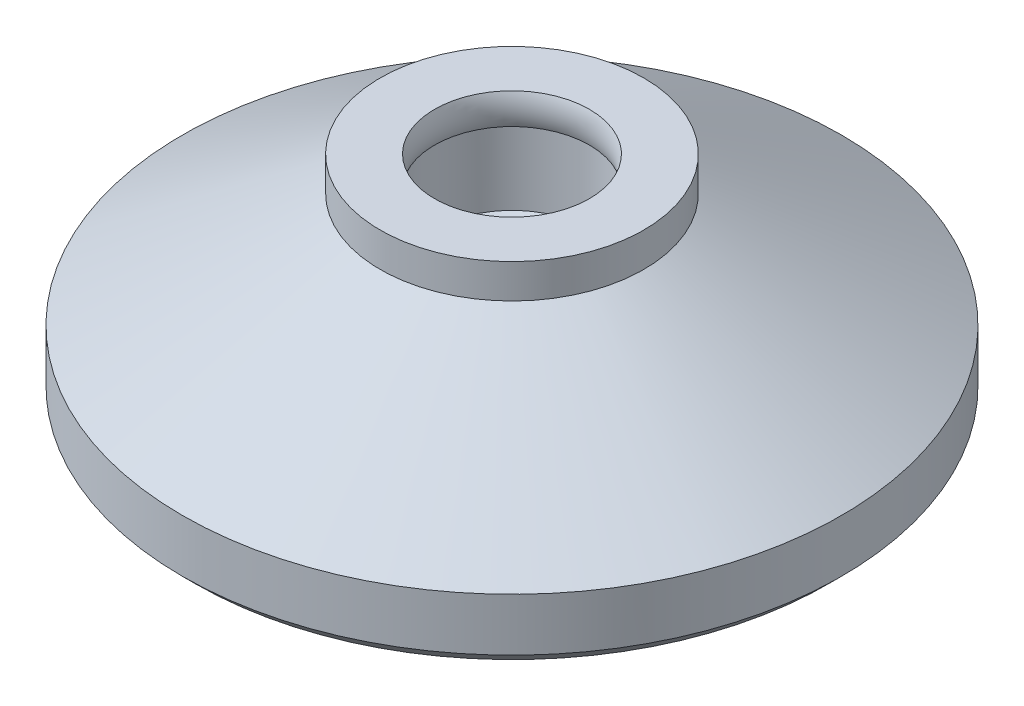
from build123d import *

# Parameters (mm, degrees)
SKETCH1_R      = 8
EXTRUDE1_DEPTH = 6.5
SKETCH3_R      = 20
EXTRUDE2_DEPTH = 4
CHAMFER1_SIZE  = 0.8


with BuildPart() as part:
    # Sketch1 → Extrude1 (new, symmetric)
    with BuildSketch(Plane(origin=(0, 0, 0), x_dir=(1, 0, 0), z_dir=(0, 1, 0))):
        with Locations(Location((0, 0, 0), (0, 0, 90))):
            Circle(SKETCH1_R)
    extrude(amount=EXTRUDE1_DEPTH, both=True)

    # Sketch3 → Extrude2 (add)
    with BuildSketch(Plane.XZ.offset(6.5)):
        with Locations(Location((0, 0, 0), (0, 0, 270))):
            Circle(SKETCH3_R)
    extrude(amount=-EXTRUDE2_DEPTH)

    # Sketch4 → Revolve1 (revolve)
    with BuildSketch(Plane.XY, mode=Mode.PRIVATE) as revolve1_sk:
        Polygon((-20, -2.5), (-8, 4.42820323), (-8, -2.5), align=None)
    revolve(revolve1_sk.sketch.rotate(Axis((0, 6.5, 0), (0, -1, 0)), 90), axis=Axis((0, 6.5, 0), (0, -1, 0)))

    # Chamfer1
    chamfer1_edges = [part.edges().sort_by_distance(p)[0] for p in [
        (0, -6.5, 20),
    ]]
    chamfer(chamfer1_edges, length=CHAMFER1_SIZE)

    # Sketch5 → Cut-Revolve1 (revolve, cut)
    with BuildSketch(Plane.XY, mode=Mode.PRIVATE) as cut_revolve1_sk:
        with BuildLine():
            Line((0, 6.5), (4.7, 6.5))
            ThreePointArc((4.7, 6.5), (4.512, 5.56), (4.7, 4.62))
            Line((4.7, 4.62), (4.7, 0.213546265))
            Line((4.7, 0.213546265), (0, -2.5))
            Line((0, -2.5), (0, 6.5))
        make_face()
    revolve(cut_revolve1_sk.sketch.rotate(Axis((0, 0, 0), (0, 1, 0)), 270), axis=Axis((0, 0, 0), (0, 1, 0)), mode=Mode.SUBTRACT)


solid = part.part
